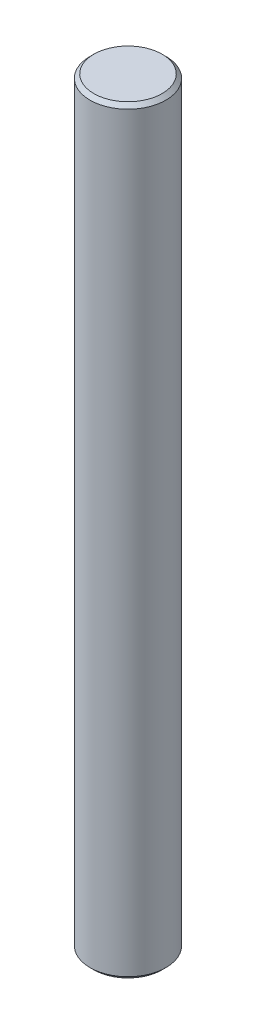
ISO-10303-21;
HEADER;
FILE_DESCRIPTION(('STEP AP214'),'2;1');
FILE_NAME('part.step','',(''),(''),'','','');
FILE_SCHEMA(('AUTOMOTIVE_DESIGN { 1 0 10303 214 1 1 1 1 }'));
ENDSEC;
DATA;
#1=APPLICATION_CONTEXT('core data for automotive mechanical design processes');
#2=APPLICATION_PROTOCOL_DEFINITION('international standard','automotive_design',2000,#1);
#3=PRODUCT_CONTEXT('',#1,'mechanical');
#4=PRODUCT('Part','Part','',(#3));
#5=PRODUCT_RELATED_PRODUCT_CATEGORY('part','',(#4));
#6=PRODUCT_DEFINITION_FORMATION('','',#4);
#7=PRODUCT_DEFINITION_CONTEXT('part definition',#1,'design');
#8=PRODUCT_DEFINITION('design','',#6,#7);
#9=PRODUCT_DEFINITION_SHAPE('','',#8);
#10=(LENGTH_UNIT() NAMED_UNIT(*) SI_UNIT(.MILLI.,.METRE.));
#11=(NAMED_UNIT(*) PLANE_ANGLE_UNIT() SI_UNIT($,.RADIAN.));
#12=(NAMED_UNIT(*) SI_UNIT($,.STERADIAN.) SOLID_ANGLE_UNIT());
#13=UNCERTAINTY_MEASURE_WITH_UNIT(LENGTH_MEASURE(1.E-05),#10,'distance_accuracy_value','');
#14=(GEOMETRIC_REPRESENTATION_CONTEXT(3) GLOBAL_UNCERTAINTY_ASSIGNED_CONTEXT((#13)) GLOBAL_UNIT_ASSIGNED_CONTEXT((#10,
#11,#12)) REPRESENTATION_CONTEXT('',''));
#15=CARTESIAN_POINT('',(0.,0.,0.));
#16=DIRECTION('',(0.,0.,1.));
#17=DIRECTION('',(1.,0.,0.));
#18=AXIS2_PLACEMENT_3D('',#15,#16,#17);
#19=CARTESIAN_POINT('',(0.,20.,0.));
#20=DIRECTION('',(0.,-1.,0.));
#21=DIRECTION('',(0.,0.,-1.));
#22=AXIS2_PLACEMENT_3D('',#19,#20,#21);
#23=CYLINDRICAL_SURFACE('',#22,1.);
#24=CARTESIAN_POINT('',(0.,0.100000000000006,0.));
#25=DIRECTION('',(0.,1.,0.));
#26=DIRECTION('',(0.,0.,1.));
#27=AXIS2_PLACEMENT_3D('',#24,#25,#26);
#28=CIRCLE('',#27,1.);
#29=CARTESIAN_POINT('',(0.,0.100000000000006,1.));
#30=VERTEX_POINT('',#29);
#31=EDGE_CURVE('E52',#30,#30,#28,.T.);
#32=ORIENTED_EDGE('',*,*,#31,.T.);
#33=EDGE_LOOP('',(#32));
#34=FACE_BOUND('',#33,.T.);
#35=CARTESIAN_POINT('',(0.,19.9,0.));
#36=DIRECTION('',(0.,1.,0.));
#37=DIRECTION('',(0.,0.,1.));
#38=AXIS2_PLACEMENT_3D('',#35,#36,#37);
#39=CIRCLE('',#38,1.);
#40=CARTESIAN_POINT('',(0.,19.9,1.));
#41=VERTEX_POINT('',#40);
#42=EDGE_CURVE('E56',#41,#41,#39,.F.);
#43=ORIENTED_EDGE('',*,*,#42,.T.);
#44=EDGE_LOOP('',(#43));
#45=FACE_BOUND('',#44,.T.);
#46=ADVANCED_FACE('F40',(#34,#45),#23,.T.);
#47=CARTESIAN_POINT('',(0.,20.,0.));
#48=DIRECTION('',(0.,1.,0.));
#49=DIRECTION('',(0.,0.,1.));
#50=AXIS2_PLACEMENT_3D('',#47,#48,#49);
#51=PLANE('',#50);
#52=CARTESIAN_POINT('',(0.,20.,0.));
#53=DIRECTION('',(0.,1.,0.));
#54=DIRECTION('',(0.,0.,1.));
#55=AXIS2_PLACEMENT_3D('',#52,#53,#54);
#56=CIRCLE('',#55,0.900000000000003);
#57=CARTESIAN_POINT('',(0.,20.,0.900000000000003));
#58=VERTEX_POINT('',#57);
#59=EDGE_CURVE('E10',#58,#58,#56,.T.);
#60=ORIENTED_EDGE('',*,*,#59,.T.);
#61=EDGE_LOOP('',(#60));
#62=FACE_BOUND('',#61,.T.);
#63=ADVANCED_FACE('F72',(#62),#51,.T.);
#64=CARTESIAN_POINT('',(0.,0.,0.));
#65=DIRECTION('',(0.,1.,0.));
#66=DIRECTION('',(0.,0.,1.));
#67=AXIS2_PLACEMENT_3D('',#64,#65,#66);
#68=PLANE('',#67);
#69=CARTESIAN_POINT('',(0.,0.,0.));
#70=DIRECTION('',(0.,1.,0.));
#71=DIRECTION('',(0.,0.,1.));
#72=AXIS2_PLACEMENT_3D('',#69,#70,#71);
#73=CIRCLE('',#72,0.899999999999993);
#74=CARTESIAN_POINT('',(0.,0.,0.899999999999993));
#75=VERTEX_POINT('',#74);
#76=EDGE_CURVE('E48',#75,#75,#73,.F.);
#77=ORIENTED_EDGE('',*,*,#76,.T.);
#78=EDGE_LOOP('',(#77));
#79=FACE_BOUND('',#78,.T.);
#80=ADVANCED_FACE('F69',(#79),#68,.F.);
#81=CARTESIAN_POINT('',(0.,0.100000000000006,0.));
#82=DIRECTION('',(0.,1.,0.));
#83=DIRECTION('',(0.,0.,1.));
#84=AXIS2_PLACEMENT_3D('',#81,#82,#83);
#85=CONICAL_SURFACE('',#84,1.,0.785398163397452);
#86=ORIENTED_EDGE('',*,*,#76,.F.);
#87=EDGE_LOOP('',(#86));
#88=FACE_BOUND('',#87,.T.);
#89=ORIENTED_EDGE('',*,*,#31,.F.);
#90=EDGE_LOOP('',(#89));
#91=FACE_BOUND('',#90,.T.);
#92=ADVANCED_FACE('F65',(#88,#91),#85,.T.);
#93=CARTESIAN_POINT('',(0.,20.,0.));
#94=DIRECTION('',(0.,-1.,0.));
#95=DIRECTION('',(0.,0.,-1.));
#96=AXIS2_PLACEMENT_3D('',#93,#94,#95);
#97=CONICAL_SURFACE('',#96,0.900000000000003,0.785398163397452);
#98=ORIENTED_EDGE('',*,*,#42,.F.);
#99=EDGE_LOOP('',(#98));
#100=FACE_BOUND('',#99,.T.);
#101=ORIENTED_EDGE('',*,*,#59,.F.);
#102=EDGE_LOOP('',(#101));
#103=FACE_BOUND('',#102,.T.);
#104=ADVANCED_FACE('F43',(#100,#103),#97,.T.);
#105=CLOSED_SHELL('',(#46,#63,#80,#92,#104));
#106=MANIFOLD_SOLID_BREP('B2',#105);
#107=ADVANCED_BREP_SHAPE_REPRESENTATION('',(#18,#106),#14);
#108=SHAPE_DEFINITION_REPRESENTATION(#9,#107);
ENDSEC;
END-ISO-10303-21;
